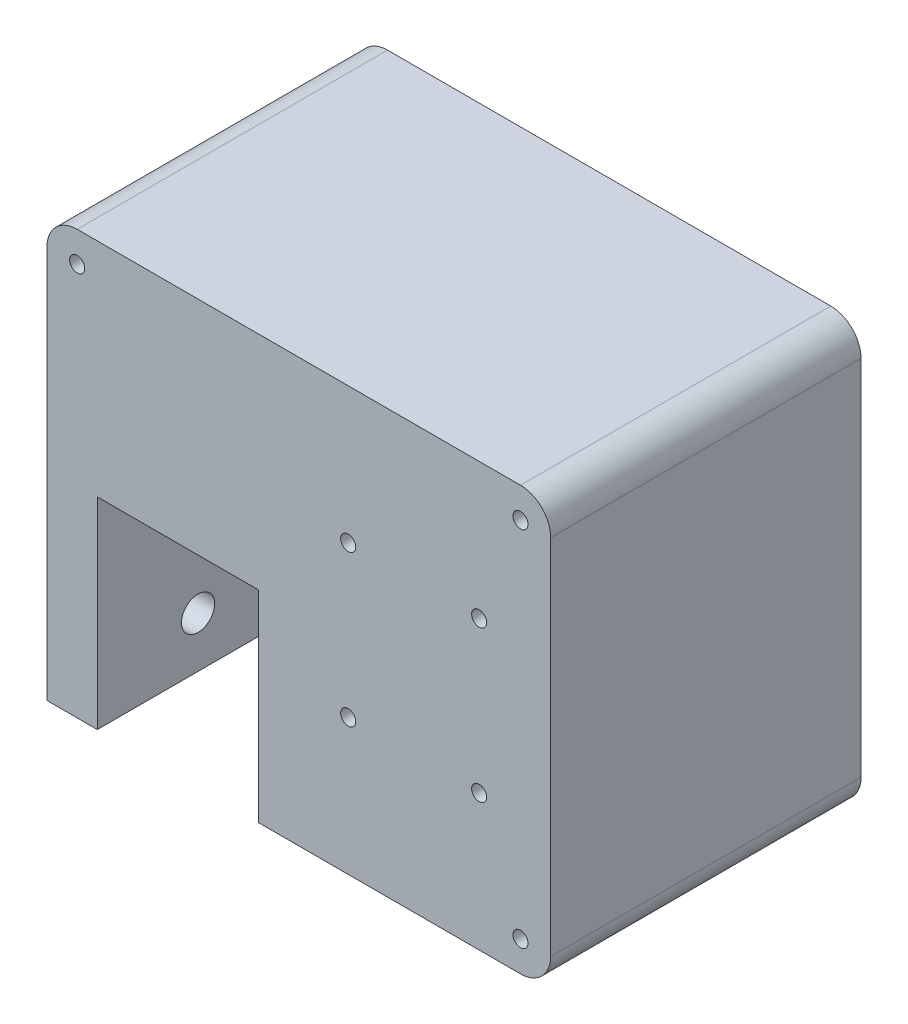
from build123d import *

# Parameters (mm, degrees)
ESQUISSE1_R                  = 12
BOSS_EXTRU_1_DEPTH           = 20
ESQUISSE2_R                  = 15
ESQUISSE2_R_2                = 6
BOSS_EXTRU_2_DEPTH           = 6
ENL_V_MAT_EXTRU_1_DEPTH      = 79.287930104
ENL_V_MAT_EXTRU_1_DEPTH_BACK = 79.287930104
ESQUISSE3_R                  = 3
ESQUISSE4_W                  = 5
ESQUISSE4_H                  = 3.2
ESQUISSE5_R                  = 1.5
BOSS_EXTRU_3_DEPTH           = 1.6
ESQUISSE6_R                  = 1.5
BOSS_EXTRU_4_DEPTH           = 60
ENL_V_MAT_EXTRU_2_DEPTH      = 111.004545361
ENL_V_MAT_EXTRU_2_DEPTH_BACK = 111.004545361
ESQUISSE7_W                  = 32
ESQUISSE7_H                  = 40
ESQUISSE8_R                  = 3.3
ENL_V_MAT_EXTRU_3_DEPTH      = 14
ESQUISSE9_R                  = 5
ESQUISSE9_R_2                = 1.5
BOSS_EXTRU_5_DEPTH           = 10
CHANFREIN1_SIZE              = 2.5
ENL_V_START                  = 4
ESQUISSE10_W                 = 18
ESQUISSE10_H                 = 15.939810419
ESQUISSE10_W_2               = 22
ENL_V_MAT_EXTRU_4_DEPTH      = 30
ESQUISSE11_R                 = 1.45
ENL_V_MAT_EXTRU_5_DEPTH      = 20
ESQUISSE12_R                 = 1.25
ESQUISSE12_R_2               = 5
ENL_V_MAT_EXTRU_6_DEPTH      = 10


with BuildPart() as part:
    # Esquisse1 → Boss.-Extru.1 (new, symmetric)
    with BuildSketch(Plane.XY):
        with BuildLine():
            Line((-16, -55), (-26, -55))
            Line((-26, -55), (-26, 8))
            ThreePointArc((-26, 8), (-23.071067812, 15.071067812), (-16, 18))
            Line((-16, 18), (16, 18))
            ThreePointArc((16, 18), (23.071067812, 15.071067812), (26, 8))
            Line((26, 8), (26, -55))
            Line((26, -55), (16, -55))
            Line((16, -55), (16, -15))
            Line((16, -15), (-16, -15))
            Line((-16, -15), (-16, -55))
        make_face()
        Circle(ESQUISSE1_R, mode=Mode.SUBTRACT)
    extrude(amount=BOSS_EXTRU_1_DEPTH, both=True)

    # Esquisse2 → Boss.-Extru.2 (add)
    with BuildSketch(Plane.XY.offset(20)):
        Circle(ESQUISSE2_R)
        Circle(ESQUISSE2_R_2, mode=Mode.SUBTRACT)
    extrude(amount=-BOSS_EXTRU_2_DEPTH)

    # Esquisse3 → Enl_v. mat.-Extru.1 (cut, two sides: drawn at the far end of the back side and taken through both)
    with BuildSketch(Plane(origin=(26, 0, 0), x_dir=(0, 0, -1), z_dir=(1, 0, 0)).offset(-ENL_V_MAT_EXTRU_1_DEPTH_BACK)):
        with Locations(Location((0, -45, 0), (0, 0, 90))):
            Circle(ESQUISSE3_R)
        with Locations(Location((0, -25, 0), (0, 0, 90))):
            Circle(ESQUISSE3_R)
    extrude(amount=ENL_V_MAT_EXTRU_1_DEPTH + ENL_V_MAT_EXTRU_1_DEPTH_BACK, mode=Mode.SUBTRACT)

    # Esquisse4 → R_volution1 (revolve)
    with BuildSketch(Plane(origin=(0, 0, 0), x_dir=(0, 0, -1), z_dir=(1, 0, 0)), mode=Mode.PRIVATE) as r_volution1_sk:
        with Locations((-11.5, 10.4)):
            Rectangle(ESQUISSE4_W, ESQUISSE4_H)
    revolve(r_volution1_sk.sketch.rotate(Axis((0, 0, 0), (0, 0, 1)), 90), axis=Axis((0, 0, 0), (0, 0, 1)))

    # Esquisse5 → Boss.-Extru.3 (add)
    with BuildSketch(Plane.XY.offset(20)):
        with BuildLine():
            Line((-20, -55), (68, -55))
            ThreePointArc((68, -55), (72.242640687, -53.242640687), (74, -49))
            Line((74, -49), (74, 23))
            ThreePointArc((74, 23), (72.242640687, 27.242640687), (68, 29))
            Line((68, 29), (-20, 29))
            ThreePointArc((-20, 29), (-24.242640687, 27.242640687), (-26, 23))
            Line((-26, 23), (-26, -49))
            ThreePointArc((-26, -49), (-24.242640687, -53.242640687), (-20, -55))
        make_face()
        with Locations((33.8, 2)):
            Circle(ESQUISSE5_R, mode=Mode.SUBTRACT)
        with Locations((59.8, 2)):
            Circle(ESQUISSE5_R, mode=Mode.SUBTRACT)
        with Locations((59.8, -28)):
            Circle(ESQUISSE5_R, mode=Mode.SUBTRACT)
        with Locations((33.8, -28)):
            Circle(ESQUISSE5_R, mode=Mode.SUBTRACT)
        with Locations((-20, 23)):
            Circle(ESQUISSE5_R, mode=Mode.SUBTRACT)
        with Locations((68, 23)):
            Circle(ESQUISSE5_R, mode=Mode.SUBTRACT)
        with Locations((68, -49)):
            Circle(ESQUISSE5_R, mode=Mode.SUBTRACT)
        with Locations((-20, -49)):
            Circle(ESQUISSE5_R, mode=Mode.SUBTRACT)
    extrude(amount=-BOSS_EXTRU_3_DEPTH)

    # Esquisse6 → Boss.-Extru.4 (add)
    with BuildSketch(Plane(origin=(0, 0, 18.4), x_dir=(-1, 0, 0), z_dir=(0, 0, -1))):
        with BuildLine():
            Line((-68, -55), (20, -55))
            ThreePointArc((20, -55), (24.242640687, -53.242640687), (26, -49))
            Line((26, -49), (26, 23))
            ThreePointArc((26, 23), (24.242640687, 27.242640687), (20, 29))
            Line((20, 29), (-68, 29))
            ThreePointArc((-68, 29), (-72.242640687, 27.242640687), (-74, 23))
            Line((-74, 23), (-74, -49))
            ThreePointArc((-74, -49), (-72.242640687, -53.242640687), (-68, -55))
        make_face()
        with Locations(Location((-68, -49, 0), (0, 0, 180))):
            Circle(ESQUISSE6_R, mode=Mode.SUBTRACT)
        with Locations(Location((20, -49, 0), (0, 0, 180))):
            Circle(ESQUISSE6_R, mode=Mode.SUBTRACT)
        with Locations(Location((20, 23, 0), (0, 0, 180))):
            Circle(ESQUISSE6_R, mode=Mode.SUBTRACT)
        with Locations(Location((-68, 23, 0), (0, 0, 180))):
            Circle(ESQUISSE6_R, mode=Mode.SUBTRACT)
        Polygon((-72.2, -38.2), (-72.2, 12.2), (-57.2, 27.2), (9.2, 27.2), (24.2, 12.2), (24.2, -38.2), (9.2, -53.2), (-57.2, -53.2), align=None, mode=Mode.SUBTRACT)
    extrude(amount=BOSS_EXTRU_4_DEPTH)

    # Esquisse7 → Enl_v. mat.-Extru.2 (cut, two sides: drawn at the far end of the back side and taken through both)
    with BuildSketch(Plane(origin=(0, 0, 18.4), x_dir=(-1, 0, 0), z_dir=(0, 0, -1)).offset(-ENL_V_MAT_EXTRU_2_DEPTH_BACK)):
        with Locations((0, -35)):
            Rectangle(ESQUISSE7_W, ESQUISSE7_H)
    extrude(amount=ENL_V_MAT_EXTRU_2_DEPTH + ENL_V_MAT_EXTRU_2_DEPTH_BACK, mode=Mode.SUBTRACT)

    # Esquisse8 → Enl_v. mat.-Extru.3 (cut)
    with BuildSketch(Plane.ZY.offset(26)):
        with Locations((0, -25)):
            Circle(ESQUISSE8_R)
        with Locations((0, -45)):
            Circle(ESQUISSE8_R)
    extrude(amount=-ENL_V_MAT_EXTRU_3_DEPTH, mode=Mode.SUBTRACT)

    # Esquisse9 → Boss.-Extru.5 (add)
    # profile 1 of 4: a face of its own
    with BuildSketch(Plane(origin=(0, 0, 18.4), x_dir=(-1, 0, 0), z_dir=(0, 0, -1))):
        with Locations(Location((-59.8, 2, 0), (0, 0, 180))):
            Circle(ESQUISSE9_R)
        with Locations(Location((-59.8, 2, 0), (0, 0, 180))):
            Circle(ESQUISSE9_R_2, mode=Mode.SUBTRACT)
    # profile 2 of 4: a face of its own
    with BuildSketch(Plane(origin=(0, 0, 18.4), x_dir=(-1, 0, 0), z_dir=(0, 0, -1))):
        with Locations(Location((-59.8, -28, 0), (0, 0, 180))):
            Circle(ESQUISSE9_R)
        with Locations(Location((-59.8, -28, 0), (0, 0, 180))):
            Circle(ESQUISSE9_R_2, mode=Mode.SUBTRACT)
    # profile 3 of 4: a face of its own
    with BuildSketch(Plane(origin=(0, 0, 18.4), x_dir=(-1, 0, 0), z_dir=(0, 0, -1))):
        with Locations(Location((-33.8, -28, 0), (0, 0, 180))):
            Circle(ESQUISSE9_R)
        with Locations(Location((-33.8, -28, 0), (0, 0, 180))):
            Circle(ESQUISSE9_R_2, mode=Mode.SUBTRACT)
    # profile 4 of 4: a face of its own
    with BuildSketch(Plane(origin=(0, 0, 18.4), x_dir=(-1, 0, 0), z_dir=(0, 0, -1))):
        with Locations(Location((-33.8, 2, 0), (0, 0, 180))):
            Circle(ESQUISSE9_R)
        with Locations(Location((-33.8, 2, 0), (0, 0, 180))):
            Circle(ESQUISSE9_R_2, mode=Mode.SUBTRACT)
    extrude(amount=BOSS_EXTRU_5_DEPTH)

    # Chanfrein1
    chanfrein1_edges = [part.edges().sort_by_distance(p)[0] for p in [
        (54.8, 2, 18.4),
        (54.8, 2, 8.4),
        (54.8, -28, 18.4),
        (54.8, -28, 8.4),
        (28.8, -28, 18.4),
        (28.8, -28, 8.4),
        (28.8, 2, 18.4),
        (28.8, 2, 8.4),
    ]]
    chamfer(chanfrein1_edges, length=CHANFREIN1_SIZE)

    # Esquisse10 → Enl_v. mat.-Extru.4 (cut)
    with BuildSketch(Plane(origin=(0, 0, 5.5), x_dir=(-1, 0, 0), z_dir=(0, 0, -1)).offset(ENL_V_START)):
        with Locations((-92.27, -51.572748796)):
            Rectangle(ESQUISSE10_W, ESQUISSE10_H)
        with Locations((54.6, -51.572748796)):
            Rectangle(ESQUISSE10_W_2, ESQUISSE10_H)
    extrude(amount=ENL_V_MAT_EXTRU_4_DEPTH, mode=Mode.SUBTRACT)

    # Esquisse11 → Enl_v. mat.-Extru.5 (cut)
    with BuildSketch(Plane(origin=(0, 0, -20), x_dir=(-1, 0, 0), z_dir=(0, 0, -1))):
        with Locations((-17.5, 8)):
            Circle(ESQUISSE11_R)
        with Locations((17.5, 8)):
            Circle(ESQUISSE11_R)
    extrude(amount=-ENL_V_MAT_EXTRU_5_DEPTH, mode=Mode.SUBTRACT)

    # Esquisse12 → Enl_v. mat.-Extru.6 (cut)
    with BuildSketch(Plane.XZ.offset(55)):
        with Locations(Location((32, 9, 0), (0, 0, 270))):
            Circle(ESQUISSE12_R)
        with Locations(Location((42, 9, 0), (0, 0, 270))):
            Circle(ESQUISSE12_R)
        with Locations(Location((37, -15, 0), (0, 0, 270))):
            Circle(ESQUISSE12_R_2)
    extrude(amount=-ENL_V_MAT_EXTRU_6_DEPTH, mode=Mode.SUBTRACT)


solid = part.part
